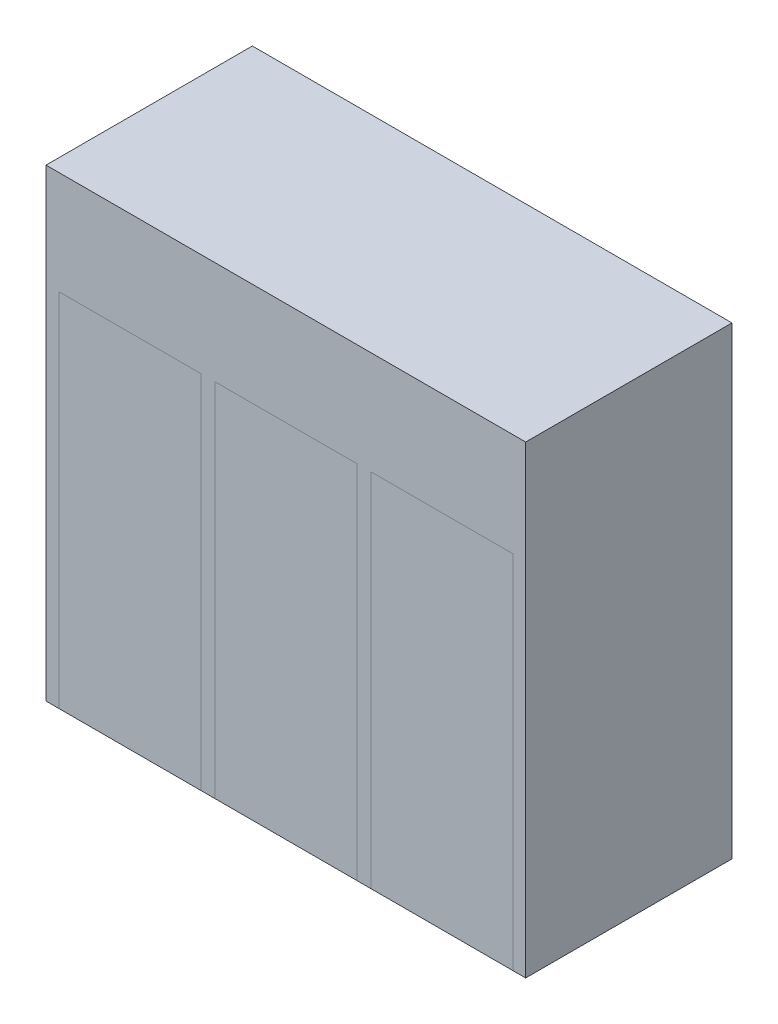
ISO-10303-21;
HEADER;
FILE_DESCRIPTION(('STEP AP214'),'2;1');
FILE_NAME('part.step','',(''),(''),'','','');
FILE_SCHEMA(('AUTOMOTIVE_DESIGN { 1 0 10303 214 1 1 1 1 }'));
ENDSEC;
DATA;
#1=APPLICATION_CONTEXT('core data for automotive mechanical design processes');
#2=APPLICATION_PROTOCOL_DEFINITION('international standard','automotive_design',2000,#1);
#3=PRODUCT_CONTEXT('',#1,'mechanical');
#4=PRODUCT('Part','Part','',(#3));
#5=PRODUCT_RELATED_PRODUCT_CATEGORY('part','',(#4));
#6=PRODUCT_DEFINITION_FORMATION('','',#4);
#7=PRODUCT_DEFINITION_CONTEXT('part definition',#1,'design');
#8=PRODUCT_DEFINITION('design','',#6,#7);
#9=PRODUCT_DEFINITION_SHAPE('','',#8);
#10=(LENGTH_UNIT() NAMED_UNIT(*) SI_UNIT(.MILLI.,.METRE.));
#11=(NAMED_UNIT(*) PLANE_ANGLE_UNIT() SI_UNIT($,.RADIAN.));
#12=(NAMED_UNIT(*) SI_UNIT($,.STERADIAN.) SOLID_ANGLE_UNIT());
#13=UNCERTAINTY_MEASURE_WITH_UNIT(LENGTH_MEASURE(1.E-05),#10,'distance_accuracy_value','');
#14=(GEOMETRIC_REPRESENTATION_CONTEXT(3) GLOBAL_UNCERTAINTY_ASSIGNED_CONTEXT((#13)) GLOBAL_UNIT_ASSIGNED_CONTEXT((#10,
#11,#12)) REPRESENTATION_CONTEXT('',''));
#15=CARTESIAN_POINT('',(0.,0.,0.));
#16=DIRECTION('',(0.,0.,1.));
#17=DIRECTION('',(1.,0.,0.));
#18=AXIS2_PLACEMENT_3D('',#15,#16,#17);
#19=CARTESIAN_POINT('',(4.13863579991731,1.45389830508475,23.0416089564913));
#20=DIRECTION('',(1.,0.,0.));
#21=DIRECTION('',(0.,0.,-1.));
#22=AXIS2_PLACEMENT_3D('',#19,#20,#21);
#23=PLANE('',#22);
#24=DIRECTION('',(0.,-1.,0.));
#25=VECTOR('',#24,1.);
#26=CARTESIAN_POINT('',(4.13863579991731,1.45389830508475,8.));
#27=LINE('',#26,#25);
#28=CARTESIAN_POINT('',(4.13863579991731,1.45389830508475,8.));
#29=VERTEX_POINT('',#28);
#30=CARTESIAN_POINT('',(4.13863579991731,-12.5461016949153,8.));
#31=VERTEX_POINT('',#30);
#32=EDGE_CURVE('E116',#29,#31,#27,.T.);
#33=ORIENTED_EDGE('',*,*,#32,.F.);
#34=DIRECTION('',(0.,0.,-1.));
#35=VECTOR('',#34,1.);
#36=CARTESIAN_POINT('',(4.13863579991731,1.45389830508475,23.0416089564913));
#37=LINE('',#36,#35);
#38=CARTESIAN_POINT('',(4.13863579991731,1.45389830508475,7.));
#39=VERTEX_POINT('',#38);
#40=EDGE_CURVE('E12',#29,#39,#37,.T.);
#41=ORIENTED_EDGE('',*,*,#40,.T.);
#42=DIRECTION('',(0.,-1.,0.));
#43=VECTOR('',#42,1.);
#44=CARTESIAN_POINT('',(4.13863579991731,1.45389830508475,7.));
#45=LINE('',#44,#43);
#46=CARTESIAN_POINT('',(4.13863579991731,-12.5461016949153,7.));
#47=VERTEX_POINT('',#46);
#48=EDGE_CURVE('E70',#39,#47,#45,.T.);
#49=ORIENTED_EDGE('',*,*,#48,.T.);
#50=DIRECTION('',(0.,0.,-1.));
#51=VECTOR('',#50,1.);
#52=CARTESIAN_POINT('',(4.13863579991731,-12.5461016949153,23.0416089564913));
#53=LINE('',#52,#51);
#54=EDGE_CURVE('E123',#31,#47,#53,.T.);
#55=ORIENTED_EDGE('',*,*,#54,.F.);
#56=EDGE_LOOP('',(#33,#41,#49,#55));
#57=FACE_BOUND('',#56,.T.);
#58=ADVANCED_FACE('F60',(#57),#23,.F.);
#59=CARTESIAN_POINT('',(4.13863579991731,-12.5461016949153,23.0416089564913));
#60=DIRECTION('',(0.,1.,0.));
#61=DIRECTION('',(0.,0.,1.));
#62=AXIS2_PLACEMENT_3D('',#59,#60,#61);
#63=PLANE('',#62);
#64=DIRECTION('',(1.,0.,0.));
#65=VECTOR('',#64,1.);
#66=CARTESIAN_POINT('',(4.13863579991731,-12.5461016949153,8.));
#67=LINE('',#66,#65);
#68=CARTESIAN_POINT('',(9.63863579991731,-12.5461016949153,8.));
#69=VERTEX_POINT('',#68);
#70=EDGE_CURVE('E120',#31,#69,#67,.T.);
#71=ORIENTED_EDGE('',*,*,#70,.F.);
#72=ORIENTED_EDGE('',*,*,#54,.T.);
#73=DIRECTION('',(1.,0.,0.));
#74=VECTOR('',#73,1.);
#75=CARTESIAN_POINT('',(4.13863579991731,-12.5461016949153,7.));
#76=LINE('',#75,#74);
#77=CARTESIAN_POINT('',(9.63863579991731,-12.5461016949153,7.));
#78=VERTEX_POINT('',#77);
#79=EDGE_CURVE('E130',#47,#78,#76,.T.);
#80=ORIENTED_EDGE('',*,*,#79,.T.);
#81=DIRECTION('',(0.,0.,-1.));
#82=VECTOR('',#81,1.);
#83=CARTESIAN_POINT('',(9.63863579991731,-12.5461016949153,23.0416089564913));
#84=LINE('',#83,#82);
#85=EDGE_CURVE('E97',#69,#78,#84,.T.);
#86=ORIENTED_EDGE('',*,*,#85,.F.);
#87=EDGE_LOOP('',(#71,#72,#80,#86));
#88=FACE_BOUND('',#87,.T.);
#89=ADVANCED_FACE('F133',(#88),#63,.F.);
#90=CARTESIAN_POINT('',(9.63863579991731,1.45389830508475,23.0416089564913));
#91=DIRECTION('',(-1.,0.,0.));
#92=DIRECTION('',(0.,0.,1.));
#93=AXIS2_PLACEMENT_3D('',#90,#91,#92);
#94=PLANE('',#93);
#95=DIRECTION('',(0.,1.,0.));
#96=VECTOR('',#95,1.);
#97=CARTESIAN_POINT('',(9.63863579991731,1.45389830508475,8.));
#98=LINE('',#97,#96);
#99=CARTESIAN_POINT('',(9.63863579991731,1.45389830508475,8.));
#100=VERTEX_POINT('',#99);
#101=EDGE_CURVE('E92',#69,#100,#98,.T.);
#102=ORIENTED_EDGE('',*,*,#101,.F.);
#103=ORIENTED_EDGE('',*,*,#85,.T.);
#104=DIRECTION('',(0.,1.,0.));
#105=VECTOR('',#104,1.);
#106=CARTESIAN_POINT('',(9.63863579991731,1.45389830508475,7.));
#107=LINE('',#106,#105);
#108=CARTESIAN_POINT('',(9.63863579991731,1.45389830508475,7.));
#109=VERTEX_POINT('',#108);
#110=EDGE_CURVE('E110',#78,#109,#107,.T.);
#111=ORIENTED_EDGE('',*,*,#110,.T.);
#112=DIRECTION('',(0.,0.,-1.));
#113=VECTOR('',#112,1.);
#114=CARTESIAN_POINT('',(9.63863579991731,1.45389830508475,23.0416089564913));
#115=LINE('',#114,#113);
#116=EDGE_CURVE('E104',#100,#109,#115,.T.);
#117=ORIENTED_EDGE('',*,*,#116,.F.);
#118=EDGE_LOOP('',(#102,#103,#111,#117));
#119=FACE_BOUND('',#118,.T.);
#120=ADVANCED_FACE('F113',(#119),#94,.F.);
#121=CARTESIAN_POINT('',(4.13863579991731,1.45389830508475,23.0416089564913));
#122=DIRECTION('',(0.,-1.,0.));
#123=DIRECTION('',(0.,0.,-1.));
#124=AXIS2_PLACEMENT_3D('',#121,#122,#123);
#125=PLANE('',#124);
#126=DIRECTION('',(-1.,0.,0.));
#127=VECTOR('',#126,1.);
#128=CARTESIAN_POINT('',(4.13863579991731,1.45389830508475,8.));
#129=LINE('',#128,#127);
#130=EDGE_CURVE('E109',#100,#29,#129,.T.);
#131=ORIENTED_EDGE('',*,*,#130,.F.);
#132=ORIENTED_EDGE('',*,*,#116,.T.);
#133=DIRECTION('',(-1.,0.,0.));
#134=VECTOR('',#133,1.);
#135=CARTESIAN_POINT('',(4.13863579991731,1.45389830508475,7.));
#136=LINE('',#135,#134);
#137=EDGE_CURVE('E64',#109,#39,#136,.T.);
#138=ORIENTED_EDGE('',*,*,#137,.T.);
#139=ORIENTED_EDGE('',*,*,#40,.F.);
#140=EDGE_LOOP('',(#131,#132,#138,#139));
#141=FACE_BOUND('',#140,.T.);
#142=ADVANCED_FACE('F105',(#141),#125,.F.);
#143=CARTESIAN_POINT('',(0.,0.,7.));
#144=DIRECTION('',(0.,0.,1.));
#145=DIRECTION('',(1.,0.,0.));
#146=AXIS2_PLACEMENT_3D('',#143,#144,#145);
#147=PLANE('',#146);
#148=ORIENTED_EDGE('',*,*,#48,.F.);
#149=ORIENTED_EDGE('',*,*,#137,.F.);
#150=ORIENTED_EDGE('',*,*,#110,.F.);
#151=ORIENTED_EDGE('',*,*,#79,.F.);
#152=EDGE_LOOP('',(#148,#149,#150,#151));
#153=FACE_BOUND('',#152,.T.);
#154=ADVANCED_FACE('F62',(#153),#147,.F.);
#155=CARTESIAN_POINT('',(0.,0.,8.));
#156=DIRECTION('',(0.,0.,1.));
#157=DIRECTION('',(1.,0.,0.));
#158=AXIS2_PLACEMENT_3D('',#155,#156,#157);
#159=PLANE('',#158);
#160=ORIENTED_EDGE('',*,*,#130,.T.);
#161=ORIENTED_EDGE('',*,*,#32,.T.);
#162=ORIENTED_EDGE('',*,*,#70,.T.);
#163=ORIENTED_EDGE('',*,*,#101,.T.);
#164=EDGE_LOOP('',(#160,#161,#162,#163));
#165=FACE_BOUND('',#164,.T.);
#166=ADVANCED_FACE('F141',(#165),#159,.T.);
#167=CLOSED_SHELL('',(#58,#89,#120,#142,#154,#166));
#168=MANIFOLD_SOLID_BREP('B2',#167);
#169=CARTESIAN_POINT('',(-1.91136420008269,1.45389830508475,23.0416089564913));
#170=DIRECTION('',(1.,0.,0.));
#171=DIRECTION('',(0.,0.,-1.));
#172=AXIS2_PLACEMENT_3D('',#169,#170,#171);
#173=PLANE('',#172);
#174=DIRECTION('',(0.,-1.,0.));
#175=VECTOR('',#174,1.);
#176=CARTESIAN_POINT('',(-1.91136420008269,1.45389830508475,8.));
#177=LINE('',#176,#175);
#178=CARTESIAN_POINT('',(-1.91136420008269,1.45389830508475,8.));
#179=VERTEX_POINT('',#178);
#180=CARTESIAN_POINT('',(-1.91136420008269,-12.5461016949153,8.));
#181=VERTEX_POINT('',#180);
#182=EDGE_CURVE('E274',#179,#181,#177,.T.);
#183=ORIENTED_EDGE('',*,*,#182,.F.);
#184=DIRECTION('',(0.,0.,-1.));
#185=VECTOR('',#184,1.);
#186=CARTESIAN_POINT('',(-1.91136420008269,1.45389830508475,23.0416089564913));
#187=LINE('',#186,#185);
#188=CARTESIAN_POINT('',(-1.91136420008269,1.45389830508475,7.));
#189=VERTEX_POINT('',#188);
#190=EDGE_CURVE('E58',#179,#189,#187,.T.);
#191=ORIENTED_EDGE('',*,*,#190,.T.);
#192=DIRECTION('',(0.,-1.,0.));
#193=VECTOR('',#192,1.);
#194=CARTESIAN_POINT('',(-1.91136420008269,1.45389830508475,7.));
#195=LINE('',#194,#193);
#196=CARTESIAN_POINT('',(-1.91136420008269,-12.5461016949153,7.));
#197=VERTEX_POINT('',#196);
#198=EDGE_CURVE('E228',#189,#197,#195,.T.);
#199=ORIENTED_EDGE('',*,*,#198,.T.);
#200=DIRECTION('',(0.,0.,-1.));
#201=VECTOR('',#200,1.);
#202=CARTESIAN_POINT('',(-1.91136420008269,-12.5461016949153,23.0416089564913));
#203=LINE('',#202,#201);
#204=EDGE_CURVE('E281',#181,#197,#203,.T.);
#205=ORIENTED_EDGE('',*,*,#204,.F.);
#206=EDGE_LOOP('',(#183,#191,#199,#205));
#207=FACE_BOUND('',#206,.T.);
#208=ADVANCED_FACE('F218',(#207),#173,.F.);
#209=CARTESIAN_POINT('',(-1.91136420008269,-12.5461016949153,23.0416089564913));
#210=DIRECTION('',(0.,1.,0.));
#211=DIRECTION('',(0.,0.,1.));
#212=AXIS2_PLACEMENT_3D('',#209,#210,#211);
#213=PLANE('',#212);
#214=DIRECTION('',(1.,0.,0.));
#215=VECTOR('',#214,1.);
#216=CARTESIAN_POINT('',(-1.91136420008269,-12.5461016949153,8.));
#217=LINE('',#216,#215);
#218=CARTESIAN_POINT('',(3.58863579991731,-12.5461016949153,8.));
#219=VERTEX_POINT('',#218);
#220=EDGE_CURVE('E278',#181,#219,#217,.T.);
#221=ORIENTED_EDGE('',*,*,#220,.F.);
#222=ORIENTED_EDGE('',*,*,#204,.T.);
#223=DIRECTION('',(1.,0.,0.));
#224=VECTOR('',#223,1.);
#225=CARTESIAN_POINT('',(-1.91136420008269,-12.5461016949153,7.));
#226=LINE('',#225,#224);
#227=CARTESIAN_POINT('',(3.58863579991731,-12.5461016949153,7.));
#228=VERTEX_POINT('',#227);
#229=EDGE_CURVE('E288',#197,#228,#226,.T.);
#230=ORIENTED_EDGE('',*,*,#229,.T.);
#231=DIRECTION('',(0.,0.,-1.));
#232=VECTOR('',#231,1.);
#233=CARTESIAN_POINT('',(3.58863579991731,-12.5461016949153,23.0416089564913));
#234=LINE('',#233,#232);
#235=EDGE_CURVE('E255',#219,#228,#234,.T.);
#236=ORIENTED_EDGE('',*,*,#235,.F.);
#237=EDGE_LOOP('',(#221,#222,#230,#236));
#238=FACE_BOUND('',#237,.T.);
#239=ADVANCED_FACE('F291',(#238),#213,.F.);
#240=CARTESIAN_POINT('',(3.58863579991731,1.45389830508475,23.0416089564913));
#241=DIRECTION('',(-1.,0.,0.));
#242=DIRECTION('',(0.,0.,1.));
#243=AXIS2_PLACEMENT_3D('',#240,#241,#242);
#244=PLANE('',#243);
#245=DIRECTION('',(0.,1.,0.));
#246=VECTOR('',#245,1.);
#247=CARTESIAN_POINT('',(3.58863579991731,1.45389830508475,8.));
#248=LINE('',#247,#246);
#249=CARTESIAN_POINT('',(3.58863579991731,1.45389830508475,8.));
#250=VERTEX_POINT('',#249);
#251=EDGE_CURVE('E250',#219,#250,#248,.T.);
#252=ORIENTED_EDGE('',*,*,#251,.F.);
#253=ORIENTED_EDGE('',*,*,#235,.T.);
#254=DIRECTION('',(0.,1.,0.));
#255=VECTOR('',#254,1.);
#256=CARTESIAN_POINT('',(3.58863579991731,1.45389830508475,7.));
#257=LINE('',#256,#255);
#258=CARTESIAN_POINT('',(3.58863579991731,1.45389830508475,7.));
#259=VERTEX_POINT('',#258);
#260=EDGE_CURVE('E268',#228,#259,#257,.T.);
#261=ORIENTED_EDGE('',*,*,#260,.T.);
#262=DIRECTION('',(0.,0.,-1.));
#263=VECTOR('',#262,1.);
#264=CARTESIAN_POINT('',(3.58863579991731,1.45389830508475,23.0416089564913));
#265=LINE('',#264,#263);
#266=EDGE_CURVE('E262',#250,#259,#265,.T.);
#267=ORIENTED_EDGE('',*,*,#266,.F.);
#268=EDGE_LOOP('',(#252,#253,#261,#267));
#269=FACE_BOUND('',#268,.T.);
#270=ADVANCED_FACE('F271',(#269),#244,.F.);
#271=CARTESIAN_POINT('',(-1.91136420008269,1.45389830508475,23.0416089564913));
#272=DIRECTION('',(0.,-1.,0.));
#273=DIRECTION('',(0.,0.,-1.));
#274=AXIS2_PLACEMENT_3D('',#271,#272,#273);
#275=PLANE('',#274);
#276=DIRECTION('',(-1.,0.,0.));
#277=VECTOR('',#276,1.);
#278=CARTESIAN_POINT('',(-1.91136420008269,1.45389830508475,8.));
#279=LINE('',#278,#277);
#280=EDGE_CURVE('E267',#250,#179,#279,.T.);
#281=ORIENTED_EDGE('',*,*,#280,.F.);
#282=ORIENTED_EDGE('',*,*,#266,.T.);
#283=DIRECTION('',(-1.,0.,0.));
#284=VECTOR('',#283,1.);
#285=CARTESIAN_POINT('',(-1.91136420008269,1.45389830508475,7.));
#286=LINE('',#285,#284);
#287=EDGE_CURVE('E222',#259,#189,#286,.T.);
#288=ORIENTED_EDGE('',*,*,#287,.T.);
#289=ORIENTED_EDGE('',*,*,#190,.F.);
#290=EDGE_LOOP('',(#281,#282,#288,#289));
#291=FACE_BOUND('',#290,.T.);
#292=ADVANCED_FACE('F263',(#291),#275,.F.);
#293=CARTESIAN_POINT('',(0.,0.,7.));
#294=DIRECTION('',(0.,0.,1.));
#295=DIRECTION('',(1.,0.,0.));
#296=AXIS2_PLACEMENT_3D('',#293,#294,#295);
#297=PLANE('',#296);
#298=ORIENTED_EDGE('',*,*,#198,.F.);
#299=ORIENTED_EDGE('',*,*,#287,.F.);
#300=ORIENTED_EDGE('',*,*,#260,.F.);
#301=ORIENTED_EDGE('',*,*,#229,.F.);
#302=EDGE_LOOP('',(#298,#299,#300,#301));
#303=FACE_BOUND('',#302,.T.);
#304=ADVANCED_FACE('F220',(#303),#297,.F.);
#305=CARTESIAN_POINT('',(0.,0.,8.));
#306=DIRECTION('',(0.,0.,1.));
#307=DIRECTION('',(1.,0.,0.));
#308=AXIS2_PLACEMENT_3D('',#305,#306,#307);
#309=PLANE('',#308);
#310=ORIENTED_EDGE('',*,*,#280,.T.);
#311=ORIENTED_EDGE('',*,*,#182,.T.);
#312=ORIENTED_EDGE('',*,*,#220,.T.);
#313=ORIENTED_EDGE('',*,*,#251,.T.);
#314=EDGE_LOOP('',(#310,#311,#312,#313));
#315=FACE_BOUND('',#314,.T.);
#316=ADVANCED_FACE('F299',(#315),#309,.T.);
#317=CLOSED_SHELL('',(#208,#239,#270,#292,#304,#316));
#318=MANIFOLD_SOLID_BREP('B6',#317);
#319=CARTESIAN_POINT('',(-7.96136420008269,1.45389830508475,23.0416089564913));
#320=DIRECTION('',(1.,0.,0.));
#321=DIRECTION('',(0.,0.,-1.));
#322=AXIS2_PLACEMENT_3D('',#319,#320,#321);
#323=PLANE('',#322);
#324=DIRECTION('',(0.,-1.,0.));
#325=VECTOR('',#324,1.);
#326=CARTESIAN_POINT('',(-7.96136420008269,1.45389830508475,8.));
#327=LINE('',#326,#325);
#328=CARTESIAN_POINT('',(-7.96136420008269,1.45389830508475,8.));
#329=VERTEX_POINT('',#328);
#330=CARTESIAN_POINT('',(-7.96136420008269,-12.5461016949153,8.));
#331=VERTEX_POINT('',#330);
#332=EDGE_CURVE('E425',#329,#331,#327,.T.);
#333=ORIENTED_EDGE('',*,*,#332,.F.);
#334=DIRECTION('',(0.,0.,-1.));
#335=VECTOR('',#334,1.);
#336=CARTESIAN_POINT('',(-7.96136420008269,1.45389830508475,23.0416089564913));
#337=LINE('',#336,#335);
#338=CARTESIAN_POINT('',(-7.96136420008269,1.45389830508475,7.));
#339=VERTEX_POINT('',#338);
#340=EDGE_CURVE('E379',#329,#339,#337,.T.);
#341=ORIENTED_EDGE('',*,*,#340,.T.);
#342=DIRECTION('',(0.,-1.,0.));
#343=VECTOR('',#342,1.);
#344=CARTESIAN_POINT('',(-7.96136420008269,1.45389830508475,7.));
#345=LINE('',#344,#343);
#346=CARTESIAN_POINT('',(-7.96136420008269,-12.5461016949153,7.));
#347=VERTEX_POINT('',#346);
#348=EDGE_CURVE('E423',#339,#347,#345,.T.);
#349=ORIENTED_EDGE('',*,*,#348,.T.);
#350=DIRECTION('',(0.,0.,-1.));
#351=VECTOR('',#350,1.);
#352=CARTESIAN_POINT('',(-7.96136420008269,-12.5461016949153,23.0416089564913));
#353=LINE('',#352,#351);
#354=EDGE_CURVE('E414',#331,#347,#353,.T.);
#355=ORIENTED_EDGE('',*,*,#354,.F.);
#356=EDGE_LOOP('',(#333,#341,#349,#355));
#357=FACE_BOUND('',#356,.T.);
#358=ADVANCED_FACE('F375',(#357),#323,.F.);
#359=CARTESIAN_POINT('',(-7.96136420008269,-12.5461016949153,23.0416089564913));
#360=DIRECTION('',(0.,1.,0.));
#361=DIRECTION('',(0.,0.,1.));
#362=AXIS2_PLACEMENT_3D('',#359,#360,#361);
#363=PLANE('',#362);
#364=DIRECTION('',(1.,0.,0.));
#365=VECTOR('',#364,1.);
#366=CARTESIAN_POINT('',(-7.96136420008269,-12.5461016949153,8.));
#367=LINE('',#366,#365);
#368=CARTESIAN_POINT('',(-2.46136420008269,-12.5461016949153,8.));
#369=VERTEX_POINT('',#368);
#370=EDGE_CURVE('E384',#331,#369,#367,.T.);
#371=ORIENTED_EDGE('',*,*,#370,.F.);
#372=ORIENTED_EDGE('',*,*,#354,.T.);
#373=DIRECTION('',(1.,0.,0.));
#374=VECTOR('',#373,1.);
#375=CARTESIAN_POINT('',(-7.96136420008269,-12.5461016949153,7.));
#376=LINE('',#375,#374);
#377=CARTESIAN_POINT('',(-2.46136420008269,-12.5461016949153,7.));
#378=VERTEX_POINT('',#377);
#379=EDGE_CURVE('E435',#347,#378,#376,.T.);
#380=ORIENTED_EDGE('',*,*,#379,.T.);
#381=DIRECTION('',(0.,0.,-1.));
#382=VECTOR('',#381,1.);
#383=CARTESIAN_POINT('',(-2.46136420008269,-12.5461016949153,23.0416089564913));
#384=LINE('',#383,#382);
#385=EDGE_CURVE('E444',#369,#378,#384,.T.);
#386=ORIENTED_EDGE('',*,*,#385,.F.);
#387=EDGE_LOOP('',(#371,#372,#380,#386));
#388=FACE_BOUND('',#387,.T.);
#389=ADVANCED_FACE('F448',(#388),#363,.F.);
#390=CARTESIAN_POINT('',(-2.46136420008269,1.45389830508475,23.0416089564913));
#391=DIRECTION('',(-1.,0.,0.));
#392=DIRECTION('',(0.,0.,1.));
#393=AXIS2_PLACEMENT_3D('',#390,#391,#392);
#394=PLANE('',#393);
#395=DIRECTION('',(0.,1.,0.));
#396=VECTOR('',#395,1.);
#397=CARTESIAN_POINT('',(-2.46136420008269,1.45389830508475,8.));
#398=LINE('',#397,#396);
#399=CARTESIAN_POINT('',(-2.46136420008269,1.45389830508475,8.));
#400=VERTEX_POINT('',#399);
#401=EDGE_CURVE('E216',#369,#400,#398,.T.);
#402=ORIENTED_EDGE('',*,*,#401,.F.);
#403=ORIENTED_EDGE('',*,*,#385,.T.);
#404=DIRECTION('',(0.,1.,0.));
#405=VECTOR('',#404,1.);
#406=CARTESIAN_POINT('',(-2.46136420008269,1.45389830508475,7.));
#407=LINE('',#406,#405);
#408=CARTESIAN_POINT('',(-2.46136420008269,1.45389830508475,7.));
#409=VERTEX_POINT('',#408);
#410=EDGE_CURVE('E445',#378,#409,#407,.T.);
#411=ORIENTED_EDGE('',*,*,#410,.T.);
#412=DIRECTION('',(0.,0.,-1.));
#413=VECTOR('',#412,1.);
#414=CARTESIAN_POINT('',(-2.46136420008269,1.45389830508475,23.0416089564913));
#415=LINE('',#414,#413);
#416=EDGE_CURVE('E397',#400,#409,#415,.T.);
#417=ORIENTED_EDGE('',*,*,#416,.F.);
#418=EDGE_LOOP('',(#402,#403,#411,#417));
#419=FACE_BOUND('',#418,.T.);
#420=ADVANCED_FACE('F447',(#419),#394,.F.);
#421=CARTESIAN_POINT('',(-7.96136420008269,1.45389830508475,23.0416089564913));
#422=DIRECTION('',(0.,-1.,0.));
#423=DIRECTION('',(0.,0.,-1.));
#424=AXIS2_PLACEMENT_3D('',#421,#422,#423);
#425=PLANE('',#424);
#426=DIRECTION('',(-1.,0.,0.));
#427=VECTOR('',#426,1.);
#428=CARTESIAN_POINT('',(-7.96136420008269,1.45389830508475,8.));
#429=LINE('',#428,#427);
#430=EDGE_CURVE('E432',#400,#329,#429,.T.);
#431=ORIENTED_EDGE('',*,*,#430,.F.);
#432=ORIENTED_EDGE('',*,*,#416,.T.);
#433=DIRECTION('',(-1.,0.,0.));
#434=VECTOR('',#433,1.);
#435=CARTESIAN_POINT('',(-7.96136420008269,1.45389830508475,7.));
#436=LINE('',#435,#434);
#437=EDGE_CURVE('E428',#409,#339,#436,.T.);
#438=ORIENTED_EDGE('',*,*,#437,.T.);
#439=ORIENTED_EDGE('',*,*,#340,.F.);
#440=EDGE_LOOP('',(#431,#432,#438,#439));
#441=FACE_BOUND('',#440,.T.);
#442=ADVANCED_FACE('F429',(#441),#425,.F.);
#443=CARTESIAN_POINT('',(0.,0.,7.));
#444=DIRECTION('',(0.,0.,1.));
#445=DIRECTION('',(1.,0.,0.));
#446=AXIS2_PLACEMENT_3D('',#443,#444,#445);
#447=PLANE('',#446);
#448=ORIENTED_EDGE('',*,*,#348,.F.);
#449=ORIENTED_EDGE('',*,*,#437,.F.);
#450=ORIENTED_EDGE('',*,*,#410,.F.);
#451=ORIENTED_EDGE('',*,*,#379,.F.);
#452=EDGE_LOOP('',(#448,#449,#450,#451));
#453=FACE_BOUND('',#452,.T.);
#454=ADVANCED_FACE('F434',(#453),#447,.F.);
#455=CARTESIAN_POINT('',(0.,0.,8.));
#456=DIRECTION('',(0.,0.,1.));
#457=DIRECTION('',(1.,0.,0.));
#458=AXIS2_PLACEMENT_3D('',#455,#456,#457);
#459=PLANE('',#458);
#460=ORIENTED_EDGE('',*,*,#430,.T.);
#461=ORIENTED_EDGE('',*,*,#332,.T.);
#462=ORIENTED_EDGE('',*,*,#370,.T.);
#463=ORIENTED_EDGE('',*,*,#401,.T.);
#464=EDGE_LOOP('',(#460,#461,#462,#463));
#465=FACE_BOUND('',#464,.T.);
#466=ADVANCED_FACE('F377',(#465),#459,.T.);
#467=CLOSED_SHELL('',(#358,#389,#420,#442,#454,#466));
#468=MANIFOLD_SOLID_BREP('B52',#467);
#469=CARTESIAN_POINT('',(-8.46136420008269,5.45389830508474,8.));
#470=DIRECTION('',(1.,0.,0.));
#471=DIRECTION('',(0.,1.,0.));
#472=AXIS2_PLACEMENT_3D('',#469,#470,#471);
#473=PLANE('',#472);
#474=DIRECTION('',(0.,-1.,0.));
#475=VECTOR('',#474,1.);
#476=CARTESIAN_POINT('',(-8.46136420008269,5.45389830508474,0.));
#477=LINE('',#476,#475);
#478=CARTESIAN_POINT('',(-8.46136420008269,5.45389830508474,0.));
#479=VERTEX_POINT('',#478);
#480=CARTESIAN_POINT('',(-8.46136420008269,-12.5461016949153,0.));
#481=VERTEX_POINT('',#480);
#482=EDGE_CURVE('E685',#479,#481,#477,.T.);
#483=ORIENTED_EDGE('',*,*,#482,.T.);
#484=DIRECTION('',(0.,0.,-1.));
#485=VECTOR('',#484,1.);
#486=CARTESIAN_POINT('',(-8.46136420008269,-12.5461016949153,8.));
#487=LINE('',#486,#485);
#488=CARTESIAN_POINT('',(-8.46136420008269,-12.5461016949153,8.));
#489=VERTEX_POINT('',#488);
#490=EDGE_CURVE('E373',#489,#481,#487,.T.);
#491=ORIENTED_EDGE('',*,*,#490,.F.);
#492=DIRECTION('',(0.,-1.,0.));
#493=VECTOR('',#492,1.);
#494=CARTESIAN_POINT('',(-8.46136420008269,5.45389830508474,8.));
#495=LINE('',#494,#493);
#496=CARTESIAN_POINT('',(-8.46136420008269,5.45389830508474,8.));
#497=VERTEX_POINT('',#496);
#498=EDGE_CURVE('E766',#497,#489,#495,.T.);
#499=ORIENTED_EDGE('',*,*,#498,.F.);
#500=DIRECTION('',(0.,0.,-1.));
#501=VECTOR('',#500,1.);
#502=CARTESIAN_POINT('',(-8.46136420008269,5.45389830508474,8.));
#503=LINE('',#502,#501);
#504=EDGE_CURVE('E784',#497,#479,#503,.T.);
#505=ORIENTED_EDGE('',*,*,#504,.T.);
#506=EDGE_LOOP('',(#483,#491,#499,#505));
#507=FACE_BOUND('',#506,.T.);
#508=ADVANCED_FACE('F523',(#507),#473,.F.);
#509=CARTESIAN_POINT('',(-8.46136420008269,-12.5461016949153,8.));
#510=DIRECTION('',(0.,1.,0.));
#511=DIRECTION('',(0.,0.,1.));
#512=AXIS2_PLACEMENT_3D('',#509,#510,#511);
#513=PLANE('',#512);
#514=DIRECTION('',(1.,0.,0.));
#515=VECTOR('',#514,1.);
#516=CARTESIAN_POINT('',(-7.96136420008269,-12.5461016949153,7.));
#517=LINE('',#516,#515);
#518=CARTESIAN_POINT('',(-7.96136420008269,-12.5461016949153,7.));
#519=VERTEX_POINT('',#518);
#520=CARTESIAN_POINT('',(-2.46136420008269,-12.5461016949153,7.));
#521=VERTEX_POINT('',#520);
#522=EDGE_CURVE('E656',#519,#521,#517,.T.);
#523=ORIENTED_EDGE('',*,*,#522,.F.);
#524=DIRECTION('',(0.,0.,1.));
#525=VECTOR('',#524,1.);
#526=CARTESIAN_POINT('',(-7.96136420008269,-12.5461016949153,7.));
#527=LINE('',#526,#525);
#528=CARTESIAN_POINT('',(-7.96136420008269,-12.5461016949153,8.));
#529=VERTEX_POINT('',#528);
#530=EDGE_CURVE('E638',#519,#529,#527,.T.);
#531=ORIENTED_EDGE('',*,*,#530,.T.);
#532=DIRECTION('',(1.,0.,0.));
#533=VECTOR('',#532,1.);
#534=CARTESIAN_POINT('',(-8.46136420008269,-12.5461016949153,8.));
#535=LINE('',#534,#533);
#536=EDGE_CURVE('E772',#489,#529,#535,.T.);
#537=ORIENTED_EDGE('',*,*,#536,.F.);
#538=ORIENTED_EDGE('',*,*,#490,.T.);
#539=DIRECTION('',(1.,0.,0.));
#540=VECTOR('',#539,1.);
#541=CARTESIAN_POINT('',(-8.46136420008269,-12.5461016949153,0.));
#542=LINE('',#541,#540);
#543=CARTESIAN_POINT('',(10.1386357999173,-12.5461016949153,0.));
#544=VERTEX_POINT('',#543);
#545=EDGE_CURVE('E788',#481,#544,#542,.T.);
#546=ORIENTED_EDGE('',*,*,#545,.T.);
#547=DIRECTION('',(0.,0.,-1.));
#548=VECTOR('',#547,1.);
#549=CARTESIAN_POINT('',(10.1386357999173,-12.5461016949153,8.));
#550=LINE('',#549,#548);
#551=CARTESIAN_POINT('',(10.1386357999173,-12.5461016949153,8.));
#552=VERTEX_POINT('',#551);
#553=EDGE_CURVE('E531',#552,#544,#550,.T.);
#554=ORIENTED_EDGE('',*,*,#553,.F.);
#555=CARTESIAN_POINT('',(9.63863579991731,-12.5461016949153,8.));
#556=VERTEX_POINT('',#555);
#557=EDGE_CURVE('E770',#556,#552,#535,.T.);
#558=ORIENTED_EDGE('',*,*,#557,.F.);
#559=DIRECTION('',(0.,0.,1.));
#560=VECTOR('',#559,1.);
#561=CARTESIAN_POINT('',(9.63863579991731,-12.5461016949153,7.));
#562=LINE('',#561,#560);
#563=CARTESIAN_POINT('',(9.63863579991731,-12.5461016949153,7.));
#564=VERTEX_POINT('',#563);
#565=EDGE_CURVE('E538',#564,#556,#562,.T.);
#566=ORIENTED_EDGE('',*,*,#565,.F.);
#567=DIRECTION('',(1.,0.,0.));
#568=VECTOR('',#567,1.);
#569=CARTESIAN_POINT('',(4.13863579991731,-12.5461016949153,7.));
#570=LINE('',#569,#568);
#571=CARTESIAN_POINT('',(4.13863579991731,-12.5461016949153,7.));
#572=VERTEX_POINT('',#571);
#573=EDGE_CURVE('E759',#572,#564,#570,.T.);
#574=ORIENTED_EDGE('',*,*,#573,.F.);
#575=DIRECTION('',(0.,0.,1.));
#576=VECTOR('',#575,1.);
#577=CARTESIAN_POINT('',(4.13863579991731,-12.5461016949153,7.));
#578=LINE('',#577,#576);
#579=CARTESIAN_POINT('',(4.13863579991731,-12.5461016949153,8.));
#580=VERTEX_POINT('',#579);
#581=EDGE_CURVE('E729',#572,#580,#578,.T.);
#582=ORIENTED_EDGE('',*,*,#581,.T.);
#583=CARTESIAN_POINT('',(3.58863579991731,-12.5461016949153,8.));
#584=VERTEX_POINT('',#583);
#585=EDGE_CURVE('E823',#584,#580,#535,.T.);
#586=ORIENTED_EDGE('',*,*,#585,.F.);
#587=DIRECTION('',(0.,0.,1.));
#588=VECTOR('',#587,1.);
#589=CARTESIAN_POINT('',(3.58863579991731,-12.5461016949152,7.));
#590=LINE('',#589,#588);
#591=CARTESIAN_POINT('',(3.58863579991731,-12.5461016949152,7.));
#592=VERTEX_POINT('',#591);
#593=EDGE_CURVE('E546',#592,#584,#590,.T.);
#594=ORIENTED_EDGE('',*,*,#593,.F.);
#595=DIRECTION('',(1.,0.,0.));
#596=VECTOR('',#595,1.);
#597=CARTESIAN_POINT('',(-1.91136420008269,-12.5461016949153,7.));
#598=LINE('',#597,#596);
#599=CARTESIAN_POINT('',(-1.91136420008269,-12.5461016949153,7.));
#600=VERTEX_POINT('',#599);
#601=EDGE_CURVE('E722',#600,#592,#598,.T.);
#602=ORIENTED_EDGE('',*,*,#601,.F.);
#603=DIRECTION('',(0.,0.,1.));
#604=VECTOR('',#603,1.);
#605=CARTESIAN_POINT('',(-1.91136420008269,-12.5461016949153,7.));
#606=LINE('',#605,#604);
#607=CARTESIAN_POINT('',(-1.91136420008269,-12.5461016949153,8.));
#608=VERTEX_POINT('',#607);
#609=EDGE_CURVE('E691',#600,#608,#606,.T.);
#610=ORIENTED_EDGE('',*,*,#609,.T.);
#611=CARTESIAN_POINT('',(-2.46136420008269,-12.5461016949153,8.));
#612=VERTEX_POINT('',#611);
#613=EDGE_CURVE('E776',#612,#608,#535,.T.);
#614=ORIENTED_EDGE('',*,*,#613,.F.);
#615=DIRECTION('',(0.,0.,1.));
#616=VECTOR('',#615,1.);
#617=CARTESIAN_POINT('',(-2.46136420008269,-12.5461016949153,7.));
#618=LINE('',#617,#616);
#619=EDGE_CURVE('E649',#521,#612,#618,.T.);
#620=ORIENTED_EDGE('',*,*,#619,.F.);
#621=EDGE_LOOP('',(#523,#531,#537,#538,#546,#554,#558,#566,#574,#582,#586,#594,#602,#610,#614,#620));
#622=FACE_BOUND('',#621,.T.);
#623=ADVANCED_FACE('F662',(#622),#513,.F.);
#624=CARTESIAN_POINT('',(10.1386357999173,5.45389830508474,8.));
#625=DIRECTION('',(1.,0.,0.));
#626=DIRECTION('',(0.,1.,0.));
#627=AXIS2_PLACEMENT_3D('',#624,#625,#626);
#628=PLANE('',#627);
#629=DIRECTION('',(0.,-1.,0.));
#630=VECTOR('',#629,1.);
#631=CARTESIAN_POINT('',(10.1386357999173,5.45389830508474,0.));
#632=LINE('',#631,#630);
#633=CARTESIAN_POINT('',(10.1386357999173,5.45389830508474,0.));
#634=VERTEX_POINT('',#633);
#635=EDGE_CURVE('E792',#634,#544,#632,.T.);
#636=ORIENTED_EDGE('',*,*,#635,.F.);
#637=DIRECTION('',(0.,0.,-1.));
#638=VECTOR('',#637,1.);
#639=CARTESIAN_POINT('',(10.1386357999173,5.45389830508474,8.));
#640=LINE('',#639,#638);
#641=CARTESIAN_POINT('',(10.1386357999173,5.45389830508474,8.));
#642=VERTEX_POINT('',#641);
#643=EDGE_CURVE('E801',#642,#634,#640,.T.);
#644=ORIENTED_EDGE('',*,*,#643,.F.);
#645=DIRECTION('',(0.,-1.,0.));
#646=VECTOR('',#645,1.);
#647=CARTESIAN_POINT('',(10.1386357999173,5.45389830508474,8.));
#648=LINE('',#647,#646);
#649=EDGE_CURVE('E775',#642,#552,#648,.T.);
#650=ORIENTED_EDGE('',*,*,#649,.T.);
#651=ORIENTED_EDGE('',*,*,#553,.T.);
#652=EDGE_LOOP('',(#636,#644,#650,#651));
#653=FACE_BOUND('',#652,.T.);
#654=ADVANCED_FACE('F807',(#653),#628,.T.);
#655=CARTESIAN_POINT('',(-8.46136420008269,5.45389830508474,8.));
#656=DIRECTION('',(0.,1.,0.));
#657=DIRECTION('',(0.,0.,1.));
#658=AXIS2_PLACEMENT_3D('',#655,#656,#657);
#659=PLANE('',#658);
#660=DIRECTION('',(1.,0.,0.));
#661=VECTOR('',#660,1.);
#662=CARTESIAN_POINT('',(-8.46136420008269,5.45389830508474,0.));
#663=LINE('',#662,#661);
#664=EDGE_CURVE('E771',#479,#634,#663,.T.);
#665=ORIENTED_EDGE('',*,*,#664,.F.);
#666=ORIENTED_EDGE('',*,*,#504,.F.);
#667=DIRECTION('',(1.,0.,0.));
#668=VECTOR('',#667,1.);
#669=CARTESIAN_POINT('',(-8.46136420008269,5.45389830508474,8.));
#670=LINE('',#669,#668);
#671=EDGE_CURVE('E780',#497,#642,#670,.T.);
#672=ORIENTED_EDGE('',*,*,#671,.T.);
#673=ORIENTED_EDGE('',*,*,#643,.T.);
#674=EDGE_LOOP('',(#665,#666,#672,#673));
#675=FACE_BOUND('',#674,.T.);
#676=ADVANCED_FACE('F816',(#675),#659,.T.);
#677=CARTESIAN_POINT('',(0.,0.,8.));
#678=DIRECTION('',(0.,0.,1.));
#679=DIRECTION('',(1.,0.,0.));
#680=AXIS2_PLACEMENT_3D('',#677,#678,#679);
#681=PLANE('',#680);
#682=DIRECTION('',(0.,-1.,0.));
#683=VECTOR('',#682,1.);
#684=CARTESIAN_POINT('',(-7.96136420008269,1.45389830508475,8.));
#685=LINE('',#684,#683);
#686=CARTESIAN_POINT('',(-7.96136420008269,1.45389830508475,8.));
#687=VERTEX_POINT('',#686);
#688=EDGE_CURVE('E644',#687,#529,#685,.T.);
#689=ORIENTED_EDGE('',*,*,#688,.F.);
#690=DIRECTION('',(-1.,0.,0.));
#691=VECTOR('',#690,1.);
#692=CARTESIAN_POINT('',(-7.96136420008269,1.45389830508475,8.));
#693=LINE('',#692,#691);
#694=CARTESIAN_POINT('',(-2.46136420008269,1.45389830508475,8.));
#695=VERTEX_POINT('',#694);
#696=EDGE_CURVE('E660',#695,#687,#693,.T.);
#697=ORIENTED_EDGE('',*,*,#696,.F.);
#698=DIRECTION('',(0.,1.,0.));
#699=VECTOR('',#698,1.);
#700=CARTESIAN_POINT('',(-2.46136420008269,1.45389830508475,8.));
#701=LINE('',#700,#699);
#702=EDGE_CURVE('E674',#612,#695,#701,.T.);
#703=ORIENTED_EDGE('',*,*,#702,.F.);
#704=ORIENTED_EDGE('',*,*,#613,.T.);
#705=DIRECTION('',(0.,-1.,0.));
#706=VECTOR('',#705,1.);
#707=CARTESIAN_POINT('',(-1.91136420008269,1.45389830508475,8.));
#708=LINE('',#707,#706);
#709=CARTESIAN_POINT('',(-1.91136420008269,1.45389830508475,8.));
#710=VERTEX_POINT('',#709);
#711=EDGE_CURVE('E675',#710,#608,#708,.T.);
#712=ORIENTED_EDGE('',*,*,#711,.F.);
#713=DIRECTION('',(-1.,0.,0.));
#714=VECTOR('',#713,1.);
#715=CARTESIAN_POINT('',(-1.91136420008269,1.45389830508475,8.));
#716=LINE('',#715,#714);
#717=CARTESIAN_POINT('',(3.58863579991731,1.45389830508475,8.));
#718=VERTEX_POINT('',#717);
#719=EDGE_CURVE('E705',#718,#710,#716,.T.);
#720=ORIENTED_EDGE('',*,*,#719,.F.);
#721=DIRECTION('',(0.,1.,0.));
#722=VECTOR('',#721,1.);
#723=CARTESIAN_POINT('',(3.58863579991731,1.45389830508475,8.));
#724=LINE('',#723,#722);
#725=EDGE_CURVE('E709',#584,#718,#724,.T.);
#726=ORIENTED_EDGE('',*,*,#725,.F.);
#727=ORIENTED_EDGE('',*,*,#585,.T.);
#728=DIRECTION('',(0.,-1.,0.));
#729=VECTOR('',#728,1.);
#730=CARTESIAN_POINT('',(4.13863579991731,1.45389830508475,8.));
#731=LINE('',#730,#729);
#732=CARTESIAN_POINT('',(4.13863579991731,1.45389830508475,8.));
#733=VERTEX_POINT('',#732);
#734=EDGE_CURVE('E704',#733,#580,#731,.T.);
#735=ORIENTED_EDGE('',*,*,#734,.F.);
#736=DIRECTION('',(-1.,0.,0.));
#737=VECTOR('',#736,1.);
#738=CARTESIAN_POINT('',(4.13863579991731,1.45389830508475,8.));
#739=LINE('',#738,#737);
#740=CARTESIAN_POINT('',(9.63863579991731,1.45389830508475,8.));
#741=VERTEX_POINT('',#740);
#742=EDGE_CURVE('E742',#741,#733,#739,.T.);
#743=ORIENTED_EDGE('',*,*,#742,.F.);
#744=DIRECTION('',(0.,1.,0.));
#745=VECTOR('',#744,1.);
#746=CARTESIAN_POINT('',(9.63863579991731,1.45389830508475,8.));
#747=LINE('',#746,#745);
#748=EDGE_CURVE('E746',#556,#741,#747,.T.);
#749=ORIENTED_EDGE('',*,*,#748,.F.);
#750=ORIENTED_EDGE('',*,*,#557,.T.);
#751=ORIENTED_EDGE('',*,*,#649,.F.);
#752=ORIENTED_EDGE('',*,*,#671,.F.);
#753=ORIENTED_EDGE('',*,*,#498,.T.);
#754=ORIENTED_EDGE('',*,*,#536,.T.);
#755=EDGE_LOOP('',(#689,#697,#703,#704,#712,#720,#726,#727,#735,#743,#749,#750,#751,#752,#753,#754));
#756=FACE_BOUND('',#755,.T.);
#757=ADVANCED_FACE('F820',(#756),#681,.T.);
#758=CARTESIAN_POINT('',(0.,0.,0.));
#759=DIRECTION('',(0.,0.,1.));
#760=DIRECTION('',(1.,0.,0.));
#761=AXIS2_PLACEMENT_3D('',#758,#759,#760);
#762=PLANE('',#761);
#763=ORIENTED_EDGE('',*,*,#482,.F.);
#764=ORIENTED_EDGE('',*,*,#664,.T.);
#765=ORIENTED_EDGE('',*,*,#635,.T.);
#766=ORIENTED_EDGE('',*,*,#545,.F.);
#767=EDGE_LOOP('',(#763,#764,#765,#766));
#768=FACE_BOUND('',#767,.T.);
#769=ADVANCED_FACE('F813',(#768),#762,.F.);
#770=CARTESIAN_POINT('',(4.13863579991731,1.45389830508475,7.));
#771=DIRECTION('',(-1.,0.,0.));
#772=DIRECTION('',(0.,-1.,0.));
#773=AXIS2_PLACEMENT_3D('',#770,#771,#772);
#774=PLANE('',#773);
#775=ORIENTED_EDGE('',*,*,#734,.T.);
#776=ORIENTED_EDGE('',*,*,#581,.F.);
#777=DIRECTION('',(0.,-1.,0.));
#778=VECTOR('',#777,1.);
#779=CARTESIAN_POINT('',(4.13863579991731,1.45389830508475,7.));
#780=LINE('',#779,#778);
#781=CARTESIAN_POINT('',(4.13863579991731,1.45389830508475,7.));
#782=VERTEX_POINT('',#781);
#783=EDGE_CURVE('E747',#782,#572,#780,.T.);
#784=ORIENTED_EDGE('',*,*,#783,.F.);
#785=DIRECTION('',(0.,0.,1.));
#786=VECTOR('',#785,1.);
#787=CARTESIAN_POINT('',(4.13863579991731,1.45389830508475,7.));
#788=LINE('',#787,#786);
#789=EDGE_CURVE('E739',#782,#733,#788,.T.);
#790=ORIENTED_EDGE('',*,*,#789,.T.);
#791=EDGE_LOOP('',(#775,#776,#784,#790));
#792=FACE_BOUND('',#791,.T.);
#793=ADVANCED_FACE('F846',(#792),#774,.F.);
#794=CARTESIAN_POINT('',(4.13863579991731,1.45389830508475,7.));
#795=DIRECTION('',(0.,1.,0.));
#796=DIRECTION('',(0.,0.,1.));
#797=AXIS2_PLACEMENT_3D('',#794,#795,#796);
#798=PLANE('',#797);
#799=ORIENTED_EDGE('',*,*,#742,.T.);
#800=ORIENTED_EDGE('',*,*,#789,.F.);
#801=DIRECTION('',(-1.,0.,0.));
#802=VECTOR('',#801,1.);
#803=CARTESIAN_POINT('',(4.13863579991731,1.45389830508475,7.));
#804=LINE('',#803,#802);
#805=CARTESIAN_POINT('',(9.63863579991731,1.45389830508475,7.));
#806=VERTEX_POINT('',#805);
#807=EDGE_CURVE('E733',#806,#782,#804,.T.);
#808=ORIENTED_EDGE('',*,*,#807,.F.);
#809=DIRECTION('',(0.,0.,1.));
#810=VECTOR('',#809,1.);
#811=CARTESIAN_POINT('',(9.63863579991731,1.45389830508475,7.));
#812=LINE('',#811,#810);
#813=EDGE_CURVE('E736',#806,#741,#812,.T.);
#814=ORIENTED_EDGE('',*,*,#813,.T.);
#815=EDGE_LOOP('',(#799,#800,#808,#814));
#816=FACE_BOUND('',#815,.T.);
#817=ADVANCED_FACE('F851',(#816),#798,.F.);
#818=CARTESIAN_POINT('',(9.63863579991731,1.45389830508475,7.));
#819=DIRECTION('',(1.,0.,0.));
#820=DIRECTION('',(0.,1.,0.));
#821=AXIS2_PLACEMENT_3D('',#818,#819,#820);
#822=PLANE('',#821);
#823=ORIENTED_EDGE('',*,*,#748,.T.);
#824=ORIENTED_EDGE('',*,*,#813,.F.);
#825=DIRECTION('',(0.,1.,0.));
#826=VECTOR('',#825,1.);
#827=CARTESIAN_POINT('',(9.63863579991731,1.45389830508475,7.));
#828=LINE('',#827,#826);
#829=EDGE_CURVE('E755',#564,#806,#828,.T.);
#830=ORIENTED_EDGE('',*,*,#829,.F.);
#831=ORIENTED_EDGE('',*,*,#565,.T.);
#832=EDGE_LOOP('',(#823,#824,#830,#831));
#833=FACE_BOUND('',#832,.T.);
#834=ADVANCED_FACE('F852',(#833),#822,.F.);
#835=CARTESIAN_POINT('',(0.,0.,7.));
#836=DIRECTION('',(0.,0.,1.));
#837=DIRECTION('',(1.,0.,0.));
#838=AXIS2_PLACEMENT_3D('',#835,#836,#837);
#839=PLANE('',#838);
#840=ORIENTED_EDGE('',*,*,#783,.T.);
#841=ORIENTED_EDGE('',*,*,#573,.T.);
#842=ORIENTED_EDGE('',*,*,#829,.T.);
#843=ORIENTED_EDGE('',*,*,#807,.T.);
#844=EDGE_LOOP('',(#840,#841,#842,#843));
#845=FACE_BOUND('',#844,.T.);
#846=ADVANCED_FACE('F848',(#845),#839,.T.);
#847=CARTESIAN_POINT('',(-1.91136420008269,1.45389830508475,7.));
#848=DIRECTION('',(-1.,0.,0.));
#849=DIRECTION('',(0.,-1.,0.));
#850=AXIS2_PLACEMENT_3D('',#847,#848,#849);
#851=PLANE('',#850);
#852=ORIENTED_EDGE('',*,*,#711,.T.);
#853=ORIENTED_EDGE('',*,*,#609,.F.);
#854=DIRECTION('',(0.,-1.,0.));
#855=VECTOR('',#854,1.);
#856=CARTESIAN_POINT('',(-1.91136420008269,1.45389830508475,7.));
#857=LINE('',#856,#855);
#858=CARTESIAN_POINT('',(-1.91136420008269,1.45389830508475,7.));
#859=VERTEX_POINT('',#858);
#860=EDGE_CURVE('E710',#859,#600,#857,.T.);
#861=ORIENTED_EDGE('',*,*,#860,.F.);
#862=DIRECTION('',(0.,0.,1.));
#863=VECTOR('',#862,1.);
#864=CARTESIAN_POINT('',(-1.91136420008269,1.45389830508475,7.));
#865=LINE('',#864,#863);
#866=EDGE_CURVE('E701',#859,#710,#865,.T.);
#867=ORIENTED_EDGE('',*,*,#866,.T.);
#868=EDGE_LOOP('',(#852,#853,#861,#867));
#869=FACE_BOUND('',#868,.T.);
#870=ADVANCED_FACE('F837',(#869),#851,.F.);
#871=CARTESIAN_POINT('',(-1.91136420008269,1.45389830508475,7.));
#872=DIRECTION('',(0.,1.,0.));
#873=DIRECTION('',(-1.,0.,0.));
#874=AXIS2_PLACEMENT_3D('',#871,#872,#873);
#875=PLANE('',#874);
#876=ORIENTED_EDGE('',*,*,#719,.T.);
#877=ORIENTED_EDGE('',*,*,#866,.F.);
#878=DIRECTION('',(-1.,0.,0.));
#879=VECTOR('',#878,1.);
#880=CARTESIAN_POINT('',(-1.91136420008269,1.45389830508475,7.));
#881=LINE('',#880,#879);
#882=CARTESIAN_POINT('',(3.58863579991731,1.45389830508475,7.));
#883=VERTEX_POINT('',#882);
#884=EDGE_CURVE('E695',#883,#859,#881,.T.);
#885=ORIENTED_EDGE('',*,*,#884,.F.);
#886=DIRECTION('',(0.,0.,1.));
#887=VECTOR('',#886,1.);
#888=CARTESIAN_POINT('',(3.58863579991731,1.45389830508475,7.));
#889=LINE('',#888,#887);
#890=EDGE_CURVE('E698',#883,#718,#889,.T.);
#891=ORIENTED_EDGE('',*,*,#890,.T.);
#892=EDGE_LOOP('',(#876,#877,#885,#891));
#893=FACE_BOUND('',#892,.T.);
#894=ADVANCED_FACE('F842',(#893),#875,.F.);
#895=CARTESIAN_POINT('',(3.58863579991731,1.45389830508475,7.));
#896=DIRECTION('',(1.,0.,0.));
#897=DIRECTION('',(0.,0.,-1.));
#898=AXIS2_PLACEMENT_3D('',#895,#896,#897);
#899=PLANE('',#898);
#900=ORIENTED_EDGE('',*,*,#725,.T.);
#901=ORIENTED_EDGE('',*,*,#890,.F.);
#902=DIRECTION('',(0.,1.,0.));
#903=VECTOR('',#902,1.);
#904=CARTESIAN_POINT('',(3.58863579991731,1.45389830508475,7.));
#905=LINE('',#904,#903);
#906=EDGE_CURVE('E718',#592,#883,#905,.T.);
#907=ORIENTED_EDGE('',*,*,#906,.F.);
#908=ORIENTED_EDGE('',*,*,#593,.T.);
#909=EDGE_LOOP('',(#900,#901,#907,#908));
#910=FACE_BOUND('',#909,.T.);
#911=ADVANCED_FACE('F885',(#910),#899,.F.);
#912=CARTESIAN_POINT('',(0.,0.,7.));
#913=DIRECTION('',(0.,0.,1.));
#914=DIRECTION('',(1.,0.,0.));
#915=AXIS2_PLACEMENT_3D('',#912,#913,#914);
#916=PLANE('',#915);
#917=ORIENTED_EDGE('',*,*,#860,.T.);
#918=ORIENTED_EDGE('',*,*,#601,.T.);
#919=ORIENTED_EDGE('',*,*,#906,.T.);
#920=ORIENTED_EDGE('',*,*,#884,.T.);
#921=EDGE_LOOP('',(#917,#918,#919,#920));
#922=FACE_BOUND('',#921,.T.);
#923=ADVANCED_FACE('F839',(#922),#916,.T.);
#924=CARTESIAN_POINT('',(-7.96136420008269,1.45389830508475,7.));
#925=DIRECTION('',(-1.,0.,0.));
#926=DIRECTION('',(0.,-1.,0.));
#927=AXIS2_PLACEMENT_3D('',#924,#925,#926);
#928=PLANE('',#927);
#929=ORIENTED_EDGE('',*,*,#688,.T.);
#930=ORIENTED_EDGE('',*,*,#530,.F.);
#931=DIRECTION('',(0.,-1.,0.));
#932=VECTOR('',#931,1.);
#933=CARTESIAN_POINT('',(-7.96136420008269,1.45389830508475,7.));
#934=LINE('',#933,#932);
#935=CARTESIAN_POINT('',(-7.96136420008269,1.45389830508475,7.));
#936=VERTEX_POINT('',#935);
#937=EDGE_CURVE('E641',#936,#519,#934,.T.);
#938=ORIENTED_EDGE('',*,*,#937,.F.);
#939=DIRECTION('',(0.,0.,1.));
#940=VECTOR('',#939,1.);
#941=CARTESIAN_POINT('',(-7.96136420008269,1.45389830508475,7.));
#942=LINE('',#941,#940);
#943=EDGE_CURVE('E682',#936,#687,#942,.T.);
#944=ORIENTED_EDGE('',*,*,#943,.T.);
#945=EDGE_LOOP('',(#929,#930,#938,#944));
#946=FACE_BOUND('',#945,.T.);
#947=ADVANCED_FACE('F640',(#946),#928,.F.);
#948=CARTESIAN_POINT('',(-7.96136420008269,1.45389830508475,7.));
#949=DIRECTION('',(0.,1.,0.));
#950=DIRECTION('',(0.,0.,1.));
#951=AXIS2_PLACEMENT_3D('',#948,#949,#950);
#952=PLANE('',#951);
#953=ORIENTED_EDGE('',*,*,#696,.T.);
#954=ORIENTED_EDGE('',*,*,#943,.F.);
#955=DIRECTION('',(-1.,0.,0.));
#956=VECTOR('',#955,1.);
#957=CARTESIAN_POINT('',(-7.96136420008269,1.45389830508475,7.));
#958=LINE('',#957,#956);
#959=CARTESIAN_POINT('',(-2.46136420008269,1.45389830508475,7.));
#960=VERTEX_POINT('',#959);
#961=EDGE_CURVE('E650',#960,#936,#958,.T.);
#962=ORIENTED_EDGE('',*,*,#961,.F.);
#963=DIRECTION('',(0.,0.,1.));
#964=VECTOR('',#963,1.);
#965=CARTESIAN_POINT('',(-2.46136420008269,1.45389830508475,7.));
#966=LINE('',#965,#964);
#967=EDGE_CURVE('E686',#960,#695,#966,.T.);
#968=ORIENTED_EDGE('',*,*,#967,.T.);
#969=EDGE_LOOP('',(#953,#954,#962,#968));
#970=FACE_BOUND('',#969,.T.);
#971=ADVANCED_FACE('F869',(#970),#952,.F.);
#972=CARTESIAN_POINT('',(-2.46136420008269,1.45389830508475,7.));
#973=DIRECTION('',(1.,0.,0.));
#974=DIRECTION('',(0.,1.,0.));
#975=AXIS2_PLACEMENT_3D('',#972,#973,#974);
#976=PLANE('',#975);
#977=ORIENTED_EDGE('',*,*,#702,.T.);
#978=ORIENTED_EDGE('',*,*,#967,.F.);
#979=DIRECTION('',(0.,1.,0.));
#980=VECTOR('',#979,1.);
#981=CARTESIAN_POINT('',(-2.46136420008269,1.45389830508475,7.));
#982=LINE('',#981,#980);
#983=EDGE_CURVE('E665',#521,#960,#982,.T.);
#984=ORIENTED_EDGE('',*,*,#983,.F.);
#985=ORIENTED_EDGE('',*,*,#619,.T.);
#986=EDGE_LOOP('',(#977,#978,#984,#985));
#987=FACE_BOUND('',#986,.T.);
#988=ADVANCED_FACE('F871',(#987),#976,.F.);
#989=CARTESIAN_POINT('',(0.,0.,7.));
#990=DIRECTION('',(0.,0.,1.));
#991=DIRECTION('',(1.,0.,0.));
#992=AXIS2_PLACEMENT_3D('',#989,#990,#991);
#993=PLANE('',#992);
#994=ORIENTED_EDGE('',*,*,#937,.T.);
#995=ORIENTED_EDGE('',*,*,#522,.T.);
#996=ORIENTED_EDGE('',*,*,#983,.T.);
#997=ORIENTED_EDGE('',*,*,#961,.T.);
#998=EDGE_LOOP('',(#994,#995,#996,#997));
#999=FACE_BOUND('',#998,.T.);
#1000=ADVANCED_FACE('F654',(#999),#993,.T.);
#1001=CLOSED_SHELL('',(#508,#623,#654,#676,#757,#769,#793,#817,#834,#846,#870,#894,#911,#923,
#947,#971,#988,#1000));
#1002=MANIFOLD_SOLID_BREP('B210',#1001);
#1003=ADVANCED_BREP_SHAPE_REPRESENTATION('',(#18,#168,#318,#468,#1002),#14);
#1004=SHAPE_DEFINITION_REPRESENTATION(#9,#1003);
ENDSEC;
END-ISO-10303-21;
